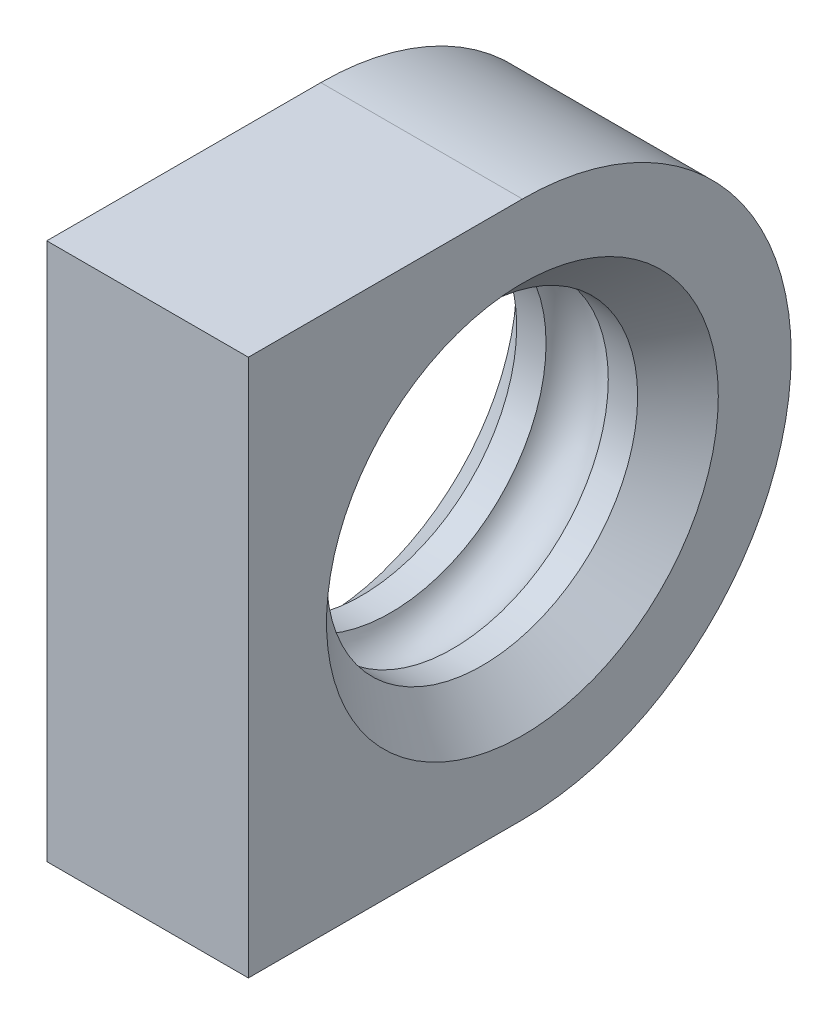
ISO-10303-21;
HEADER;
FILE_DESCRIPTION(('STEP AP214'),'2;1');
FILE_NAME('part.step','',(''),(''),'','','');
FILE_SCHEMA(('AUTOMOTIVE_DESIGN { 1 0 10303 214 1 1 1 1 }'));
ENDSEC;
DATA;
#1=APPLICATION_CONTEXT('core data for automotive mechanical design processes');
#2=APPLICATION_PROTOCOL_DEFINITION('international standard','automotive_design',2000,#1);
#3=PRODUCT_CONTEXT('',#1,'mechanical');
#4=PRODUCT('Part','Part','',(#3));
#5=PRODUCT_RELATED_PRODUCT_CATEGORY('part','',(#4));
#6=PRODUCT_DEFINITION_FORMATION('','',#4);
#7=PRODUCT_DEFINITION_CONTEXT('part definition',#1,'design');
#8=PRODUCT_DEFINITION('design','',#6,#7);
#9=PRODUCT_DEFINITION_SHAPE('','',#8);
#10=(LENGTH_UNIT() NAMED_UNIT(*) SI_UNIT(.MILLI.,.METRE.));
#11=(NAMED_UNIT(*) PLANE_ANGLE_UNIT() SI_UNIT($,.RADIAN.));
#12=(NAMED_UNIT(*) SI_UNIT($,.STERADIAN.) SOLID_ANGLE_UNIT());
#13=UNCERTAINTY_MEASURE_WITH_UNIT(LENGTH_MEASURE(1.E-05),#10,'distance_accuracy_value','');
#14=(GEOMETRIC_REPRESENTATION_CONTEXT(3) GLOBAL_UNCERTAINTY_ASSIGNED_CONTEXT((#13)) GLOBAL_UNIT_ASSIGNED_CONTEXT((#10,
#11,#12)) REPRESENTATION_CONTEXT('',''));
#15=CARTESIAN_POINT('',(0.,0.,0.));
#16=DIRECTION('',(0.,0.,1.));
#17=DIRECTION('',(1.,0.,0.));
#18=AXIS2_PLACEMENT_3D('',#15,#16,#17);
#19=CARTESIAN_POINT('',(0.,0.,0.));
#20=DIRECTION('',(1.,0.,0.));
#21=DIRECTION('',(0.,0.,-1.));
#22=AXIS2_PLACEMENT_3D('',#19,#20,#21);
#23=PLANE('',#22);
#24=DIRECTION('',(0.,0.,-1.));
#25=VECTOR('',#24,1.);
#26=CARTESIAN_POINT('',(0.,-6.35,0.));
#27=LINE('',#26,#25);
#28=CARTESIAN_POINT('',(0.,-6.35,-43.5268184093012));
#29=VERTEX_POINT('',#28);
#30=CARTESIAN_POINT('',(0.,-6.35,-50.));
#31=VERTEX_POINT('',#30);
#32=EDGE_CURVE('E104',#29,#31,#27,.T.);
#33=ORIENTED_EDGE('',*,*,#32,.F.);
#34=DIRECTION('',(0.,1.,0.));
#35=VECTOR('',#34,1.);
#36=CARTESIAN_POINT('',(0.,0.,-43.5268184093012));
#37=LINE('',#36,#35);
#38=CARTESIAN_POINT('',(0.,6.35,-43.5268184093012));
#39=VERTEX_POINT('',#38);
#40=EDGE_CURVE('E92',#29,#39,#37,.T.);
#41=ORIENTED_EDGE('',*,*,#40,.T.);
#42=DIRECTION('',(0.,0.,-1.));
#43=VECTOR('',#42,1.);
#44=CARTESIAN_POINT('',(0.,6.35,0.));
#45=LINE('',#44,#43);
#46=CARTESIAN_POINT('',(0.,6.35,-50.));
#47=VERTEX_POINT('',#46);
#48=EDGE_CURVE('E85',#39,#47,#45,.T.);
#49=ORIENTED_EDGE('',*,*,#48,.T.);
#50=CARTESIAN_POINT('',(0.,0.,-50.));
#51=DIRECTION('',(1.,0.,0.));
#52=DIRECTION('',(0.,0.,-1.));
#53=AXIS2_PLACEMENT_3D('',#50,#51,#52);
#54=CIRCLE('',#53,6.35);
#55=EDGE_CURVE('E89',#31,#47,#54,.T.);
#56=ORIENTED_EDGE('',*,*,#55,.F.);
#57=EDGE_LOOP('',(#33,#41,#49,#56));
#58=FACE_BOUND('',#57,.T.);
#59=CARTESIAN_POINT('',(0.,0.,-50.));
#60=DIRECTION('',(1.,0.,0.));
#61=DIRECTION('',(0.,0.,-1.));
#62=AXIS2_PLACEMENT_3D('',#59,#60,#61);
#63=CIRCLE('',#62,4.62749999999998);
#64=CARTESIAN_POINT('',(0.,0.,-54.6275));
#65=VERTEX_POINT('',#64);
#66=EDGE_CURVE('E110',#65,#65,#63,.T.);
#67=ORIENTED_EDGE('',*,*,#66,.T.);
#68=EDGE_LOOP('',(#67));
#69=FACE_BOUND('',#68,.T.);
#70=ADVANCED_FACE('F43',(#58,#69),#23,.F.);
#71=CARTESIAN_POINT('',(4.7625,0.,-50.));
#72=DIRECTION('',(-1.,0.,0.));
#73=DIRECTION('',(0.,0.,1.));
#74=AXIS2_PLACEMENT_3D('',#71,#72,#73);
#75=CYLINDRICAL_SURFACE('',#74,3.675);
#76=CARTESIAN_POINT('',(1.64637649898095,0.,-50.));
#77=DIRECTION('',(1.,0.,0.));
#78=DIRECTION('',(0.,0.,-1.));
#79=AXIS2_PLACEMENT_3D('',#76,#77,#78);
#80=CIRCLE('',#79,3.675);
#81=CARTESIAN_POINT('',(1.64637649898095,0.,-46.325));
#82=VERTEX_POINT('',#81);
#83=EDGE_CURVE('E48',#82,#82,#80,.F.);
#84=CARTESIAN_POINT('',(0.95249999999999,0.,-50.));
#85=DIRECTION('',(1.,0.,0.));
#86=DIRECTION('',(0.,0.,-1.));
#87=AXIS2_PLACEMENT_3D('',#84,#85,#86);
#88=CIRCLE('',#87,3.675);
#89=CARTESIAN_POINT('',(0.952499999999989,0.,-46.325));
#90=VERTEX_POINT('',#89);
#91=EDGE_CURVE('E11',#90,#90,#88,.F.);
#92=CARTESIAN_POINT('',(1.64637649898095,0.,-46.325));
#93=CARTESIAN_POINT('',(1.63914861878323,0.,-46.325));
#94=CARTESIAN_POINT('',(1.63192073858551,0.,-46.325));
#95=CARTESIAN_POINT('',(1.61746497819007,0.,-46.325));
#96=CARTESIAN_POINT('',(1.61023709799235,0.,-46.325));
#97=CARTESIAN_POINT('',(1.59578133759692,0.,-46.325));
#98=CARTESIAN_POINT('',(1.5885534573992,0.,-46.325));
#99=CARTESIAN_POINT('',(1.57409769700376,0.,-46.325));
#100=CARTESIAN_POINT('',(1.56686981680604,0.,-46.325));
#101=CARTESIAN_POINT('',(1.55241405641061,0.,-46.325));
#102=CARTESIAN_POINT('',(1.54518617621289,0.,-46.325));
#103=CARTESIAN_POINT('',(1.53073041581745,0.,-46.325));
#104=CARTESIAN_POINT('',(1.52350253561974,0.,-46.325));
#105=CARTESIAN_POINT('',(1.5090467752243,0.,-46.325));
#106=CARTESIAN_POINT('',(1.50181889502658,0.,-46.325));
#107=CARTESIAN_POINT('',(1.48736313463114,0.,-46.325));
#108=CARTESIAN_POINT('',(1.48013525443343,0.,-46.325));
#109=CARTESIAN_POINT('',(1.46567949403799,0.,-46.325));
#110=CARTESIAN_POINT('',(1.45845161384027,0.,-46.325));
#111=CARTESIAN_POINT('',(1.44399585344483,0.,-46.325));
#112=CARTESIAN_POINT('',(1.43676797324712,0.,-46.325));
#113=CARTESIAN_POINT('',(1.42231221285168,0.,-46.325));
#114=CARTESIAN_POINT('',(1.41508433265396,0.,-46.325));
#115=CARTESIAN_POINT('',(1.40062857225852,0.,-46.325));
#116=CARTESIAN_POINT('',(1.39340069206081,0.,-46.325));
#117=CARTESIAN_POINT('',(1.37894493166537,0.,-46.325));
#118=CARTESIAN_POINT('',(1.37171705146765,0.,-46.325));
#119=CARTESIAN_POINT('',(1.35726129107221,0.,-46.325));
#120=CARTESIAN_POINT('',(1.3500334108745,0.,-46.325));
#121=CARTESIAN_POINT('',(1.33557765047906,0.,-46.325));
#122=CARTESIAN_POINT('',(1.32834977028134,0.,-46.325));
#123=CARTESIAN_POINT('',(1.3138940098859,0.,-46.325));
#124=CARTESIAN_POINT('',(1.30666612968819,0.,-46.325));
#125=CARTESIAN_POINT('',(1.29221036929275,0.,-46.325));
#126=CARTESIAN_POINT('',(1.28498248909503,0.,-46.325));
#127=CARTESIAN_POINT('',(1.27052672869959,0.,-46.325));
#128=CARTESIAN_POINT('',(1.26329884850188,0.,-46.325));
#129=CARTESIAN_POINT('',(1.24884308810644,0.,-46.325));
#130=CARTESIAN_POINT('',(1.24161520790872,0.,-46.325));
#131=CARTESIAN_POINT('',(1.22715944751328,0.,-46.325));
#132=CARTESIAN_POINT('',(1.21993156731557,0.,-46.325));
#133=CARTESIAN_POINT('',(1.20547580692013,0.,-46.325));
#134=CARTESIAN_POINT('',(1.19824792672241,0.,-46.325));
#135=CARTESIAN_POINT('',(1.18379216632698,0.,-46.325));
#136=CARTESIAN_POINT('',(1.17656428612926,0.,-46.325));
#137=CARTESIAN_POINT('',(1.16210852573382,0.,-46.325));
#138=CARTESIAN_POINT('',(1.1548806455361,0.,-46.325));
#139=CARTESIAN_POINT('',(1.14042488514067,0.,-46.325));
#140=CARTESIAN_POINT('',(1.13319700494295,0.,-46.325));
#141=CARTESIAN_POINT('',(1.11874124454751,0.,-46.325));
#142=CARTESIAN_POINT('',(1.11151336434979,0.,-46.325));
#143=CARTESIAN_POINT('',(1.09705760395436,0.,-46.325));
#144=CARTESIAN_POINT('',(1.08982972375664,0.,-46.325));
#145=CARTESIAN_POINT('',(1.0753739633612,0.,-46.325));
#146=CARTESIAN_POINT('',(1.06814608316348,0.,-46.325));
#147=CARTESIAN_POINT('',(1.05369032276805,0.,-46.325));
#148=CARTESIAN_POINT('',(1.04646244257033,0.,-46.325));
#149=CARTESIAN_POINT('',(1.03200668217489,0.,-46.325));
#150=CARTESIAN_POINT('',(1.02477880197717,0.,-46.325));
#151=CARTESIAN_POINT('',(1.01032304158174,0.,-46.325));
#152=CARTESIAN_POINT('',(1.00309516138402,0.,-46.325));
#153=CARTESIAN_POINT('',(0.988639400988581,0.,-46.325));
#154=CARTESIAN_POINT('',(0.981411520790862,0.,-46.325));
#155=CARTESIAN_POINT('',(0.966955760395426,0.,-46.325));
#156=CARTESIAN_POINT('',(0.959727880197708,0.,-46.325));
#157=CARTESIAN_POINT('',(0.952499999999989,0.,-46.325));
#158=B_SPLINE_CURVE_WITH_KNOTS('',3,(#92,#93,#94,#95,#96,#97,#98,#99,#100,#101,#102,#103,#104,
#105,#106,#107,#108,#109,#110,#111,#112,#113,#114,#115,#116,#117,#118,#119,#120,#121,#122,#123,
#124,#125,#126,#127,#128,#129,#130,#131,#132,#133,#134,#135,#136,#137,#138,#139,#140,#141,#142,
#143,#144,#145,#146,#147,#148,#149,#150,#151,#152,#153,#154,#155,#156,#157),.UNSPECIFIED.,.F.,
.F.,(4,2,2,2,2,2,2,2,2,2,2,2,2,2,2,2,2,2,2,2,2,2,2,2,2,2,2,2,2,2,2,2,4),(0.,0.0216836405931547,
0.0433672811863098,0.0650509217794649,0.0867345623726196,0.108418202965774,0.130101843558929,
0.151785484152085,0.173469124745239,0.195152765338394,0.216836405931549,0.238520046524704,
0.260203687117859,0.281887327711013,0.303570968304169,0.325254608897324,0.346938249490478,
0.368621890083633,0.390305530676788,0.411989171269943,0.433672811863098,0.455356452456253,
0.477040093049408,0.498723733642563,0.520407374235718,0.542091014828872,0.563774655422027,
0.585458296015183,0.607141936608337,0.628825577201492,0.650509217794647,0.672192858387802,
0.693876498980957),.UNSPECIFIED.);
#159=EDGE_CURVE('BSEAM152',#82,#90,#158,.T.);
#160=ORIENTED_EDGE('',*,*,#83,.F.);
#161=ORIENTED_EDGE('',*,*,#91,.T.);
#162=ORIENTED_EDGE('',*,*,#159,.T.);
#163=ORIENTED_EDGE('',*,*,#159,.F.);
#164=EDGE_LOOP('',(#160,#162,#161,#163));
#165=FACE_BOUND('',#164,.T.);
#166=ADVANCED_FACE('F152',(#165),#75,.F.);
#167=CARTESIAN_POINT('',(4.7625,-6.35,0.));
#168=DIRECTION('',(0.,1.,0.));
#169=DIRECTION('',(0.,0.,1.));
#170=AXIS2_PLACEMENT_3D('',#167,#168,#169);
#171=PLANE('',#170);
#172=DIRECTION('',(0.,0.,-1.));
#173=VECTOR('',#172,1.);
#174=CARTESIAN_POINT('',(4.7625,-6.35,0.));
#175=LINE('',#174,#173);
#176=CARTESIAN_POINT('',(4.7625,-6.35,-43.5268184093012));
#177=VERTEX_POINT('',#176);
#178=CARTESIAN_POINT('',(4.7625,-6.35,-50.));
#179=VERTEX_POINT('',#178);
#180=EDGE_CURVE('E93',#177,#179,#175,.T.);
#181=ORIENTED_EDGE('',*,*,#180,.F.);
#182=DIRECTION('',(-1.,0.,0.));
#183=VECTOR('',#182,1.);
#184=CARTESIAN_POINT('',(4.7625,-6.35,-43.5268184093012));
#185=LINE('',#184,#183);
#186=EDGE_CURVE('E61',#177,#29,#185,.T.);
#187=ORIENTED_EDGE('',*,*,#186,.T.);
#188=ORIENTED_EDGE('',*,*,#32,.T.);
#189=DIRECTION('',(-1.,0.,0.));
#190=VECTOR('',#189,1.);
#191=CARTESIAN_POINT('',(4.7625,-6.35,-50.));
#192=LINE('',#191,#190);
#193=EDGE_CURVE('E100',#179,#31,#192,.T.);
#194=ORIENTED_EDGE('',*,*,#193,.F.);
#195=EDGE_LOOP('',(#181,#187,#188,#194));
#196=FACE_BOUND('',#195,.T.);
#197=ADVANCED_FACE('F135',(#196),#171,.F.);
#198=CARTESIAN_POINT('',(4.7625,0.,-50.));
#199=DIRECTION('',(-1.,0.,0.));
#200=DIRECTION('',(0.,0.,1.));
#201=AXIS2_PLACEMENT_3D('',#198,#199,#200);
#202=CYLINDRICAL_SURFACE('',#201,6.35);
#203=ORIENTED_EDGE('',*,*,#55,.T.);
#204=DIRECTION('',(-1.,0.,0.));
#205=VECTOR('',#204,1.);
#206=CARTESIAN_POINT('',(4.7625,6.35,-50.));
#207=LINE('',#206,#205);
#208=CARTESIAN_POINT('',(4.7625,6.35,-50.));
#209=VERTEX_POINT('',#208);
#210=EDGE_CURVE('E96',#209,#47,#207,.T.);
#211=ORIENTED_EDGE('',*,*,#210,.F.);
#212=CARTESIAN_POINT('',(4.7625,0.,-50.));
#213=DIRECTION('',(1.,0.,0.));
#214=DIRECTION('',(0.,0.,-1.));
#215=AXIS2_PLACEMENT_3D('',#212,#213,#214);
#216=CIRCLE('',#215,6.35);
#217=EDGE_CURVE('E130',#179,#209,#216,.T.);
#218=ORIENTED_EDGE('',*,*,#217,.F.);
#219=ORIENTED_EDGE('',*,*,#193,.T.);
#220=EDGE_LOOP('',(#203,#211,#218,#219));
#221=FACE_BOUND('',#220,.T.);
#222=ADVANCED_FACE('F102',(#221),#202,.T.);
#223=CARTESIAN_POINT('',(4.7625,6.35,0.));
#224=DIRECTION('',(0.,1.,0.));
#225=DIRECTION('',(0.,0.,1.));
#226=AXIS2_PLACEMENT_3D('',#223,#224,#225);
#227=PLANE('',#226);
#228=DIRECTION('',(-1.,0.,0.));
#229=VECTOR('',#228,1.);
#230=CARTESIAN_POINT('',(4.7625,6.35,-43.5268184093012));
#231=LINE('',#230,#229);
#232=CARTESIAN_POINT('',(4.7625,6.35,-43.5268184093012));
#233=VERTEX_POINT('',#232);
#234=EDGE_CURVE('E125',#233,#39,#231,.T.);
#235=ORIENTED_EDGE('',*,*,#234,.F.);
#236=DIRECTION('',(0.,0.,-1.));
#237=VECTOR('',#236,1.);
#238=CARTESIAN_POINT('',(4.7625,6.35,0.));
#239=LINE('',#238,#237);
#240=EDGE_CURVE('E70',#233,#209,#239,.T.);
#241=ORIENTED_EDGE('',*,*,#240,.T.);
#242=ORIENTED_EDGE('',*,*,#210,.T.);
#243=ORIENTED_EDGE('',*,*,#48,.F.);
#244=EDGE_LOOP('',(#235,#241,#242,#243));
#245=FACE_BOUND('',#244,.T.);
#246=ADVANCED_FACE('F97',(#245),#227,.T.);
#247=CARTESIAN_POINT('',(3.11612350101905,0.,-50.));
#248=DIRECTION('',(-1.,0.,0.));
#249=DIRECTION('',(0.,0.,1.));
#250=AXIS2_PLACEMENT_3D('',#247,#248,#249);
#251=CIRCLE('',#250,3.675);
#252=CARTESIAN_POINT('',(3.11612350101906,0.,-46.325));
#253=VERTEX_POINT('',#252);
#254=EDGE_CURVE('E117',#253,#253,#251,.F.);
#255=CARTESIAN_POINT('',(3.80999999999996,0.,-50.));
#256=DIRECTION('',(1.,0.,0.));
#257=DIRECTION('',(0.,0.,-1.));
#258=AXIS2_PLACEMENT_3D('',#255,#256,#257);
#259=CIRCLE('',#258,3.675);
#260=CARTESIAN_POINT('',(3.80999999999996,0.,-46.325));
#261=VERTEX_POINT('',#260);
#262=EDGE_CURVE('E53',#261,#261,#259,.T.);
#263=CARTESIAN_POINT('',(3.11612350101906,0.,-46.325));
#264=CARTESIAN_POINT('',(3.12335138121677,0.,-46.325));
#265=CARTESIAN_POINT('',(3.13057926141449,0.,-46.325));
#266=CARTESIAN_POINT('',(3.14503502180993,0.,-46.325));
#267=CARTESIAN_POINT('',(3.15226290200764,0.,-46.325));
#268=CARTESIAN_POINT('',(3.16671866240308,0.,-46.325));
#269=CARTESIAN_POINT('',(3.1739465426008,0.,-46.325));
#270=CARTESIAN_POINT('',(3.18840230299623,0.,-46.325));
#271=CARTESIAN_POINT('',(3.19563018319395,0.,-46.325));
#272=CARTESIAN_POINT('',(3.21008594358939,0.,-46.325));
#273=CARTESIAN_POINT('',(3.2173138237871,0.,-46.325));
#274=CARTESIAN_POINT('',(3.23176958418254,0.,-46.325));
#275=CARTESIAN_POINT('',(3.23899746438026,0.,-46.325));
#276=CARTESIAN_POINT('',(3.25345322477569,0.,-46.325));
#277=CARTESIAN_POINT('',(3.26068110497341,0.,-46.325));
#278=CARTESIAN_POINT('',(3.27513686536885,0.,-46.325));
#279=CARTESIAN_POINT('',(3.28236474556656,0.,-46.325));
#280=CARTESIAN_POINT('',(3.296820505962,0.,-46.325));
#281=CARTESIAN_POINT('',(3.30404838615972,0.,-46.325));
#282=CARTESIAN_POINT('',(3.31850414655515,0.,-46.325));
#283=CARTESIAN_POINT('',(3.32573202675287,0.,-46.325));
#284=CARTESIAN_POINT('',(3.3401877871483,0.,-46.325));
#285=CARTESIAN_POINT('',(3.34741566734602,0.,-46.325));
#286=CARTESIAN_POINT('',(3.36187142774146,0.,-46.325));
#287=CARTESIAN_POINT('',(3.36909930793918,0.,-46.325));
#288=CARTESIAN_POINT('',(3.38355506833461,0.,-46.325));
#289=CARTESIAN_POINT('',(3.39078294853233,0.,-46.325));
#290=CARTESIAN_POINT('',(3.40523870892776,0.,-46.325));
#291=CARTESIAN_POINT('',(3.41246658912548,0.,-46.325));
#292=CARTESIAN_POINT('',(3.42692234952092,0.,-46.325));
#293=CARTESIAN_POINT('',(3.43415022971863,0.,-46.325));
#294=CARTESIAN_POINT('',(3.44860599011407,0.,-46.325));
#295=CARTESIAN_POINT('',(3.45583387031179,0.,-46.325));
#296=CARTESIAN_POINT('',(3.47028963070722,0.,-46.325));
#297=CARTESIAN_POINT('',(3.47751751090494,0.,-46.325));
#298=CARTESIAN_POINT('',(3.49197327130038,0.,-46.325));
#299=CARTESIAN_POINT('',(3.49920115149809,0.,-46.325));
#300=CARTESIAN_POINT('',(3.51365691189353,0.,-46.325));
#301=CARTESIAN_POINT('',(3.52088479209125,0.,-46.325));
#302=CARTESIAN_POINT('',(3.53534055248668,0.,-46.325));
#303=CARTESIAN_POINT('',(3.5425684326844,0.,-46.325));
#304=CARTESIAN_POINT('',(3.55702419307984,0.,-46.325));
#305=CARTESIAN_POINT('',(3.56425207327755,0.,-46.325));
#306=CARTESIAN_POINT('',(3.57870783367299,0.,-46.325));
#307=CARTESIAN_POINT('',(3.58593571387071,0.,-46.325));
#308=CARTESIAN_POINT('',(3.60039147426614,0.,-46.325));
#309=CARTESIAN_POINT('',(3.60761935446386,0.,-46.325));
#310=CARTESIAN_POINT('',(3.6220751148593,0.,-46.325));
#311=CARTESIAN_POINT('',(3.62930299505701,0.,-46.325));
#312=CARTESIAN_POINT('',(3.64375875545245,0.,-46.325));
#313=CARTESIAN_POINT('',(3.65098663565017,0.,-46.325));
#314=CARTESIAN_POINT('',(3.6654423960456,0.,-46.325));
#315=CARTESIAN_POINT('',(3.67267027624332,0.,-46.325));
#316=CARTESIAN_POINT('',(3.68712603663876,0.,-46.325));
#317=CARTESIAN_POINT('',(3.69435391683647,0.,-46.325));
#318=CARTESIAN_POINT('',(3.70880967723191,0.,-46.325));
#319=CARTESIAN_POINT('',(3.71603755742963,0.,-46.325));
#320=CARTESIAN_POINT('',(3.73049331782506,0.,-46.325));
#321=CARTESIAN_POINT('',(3.73772119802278,0.,-46.325));
#322=CARTESIAN_POINT('',(3.75217695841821,0.,-46.325));
#323=CARTESIAN_POINT('',(3.75940483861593,0.,-46.325));
#324=CARTESIAN_POINT('',(3.77386059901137,0.,-46.325));
#325=CARTESIAN_POINT('',(3.78108847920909,0.,-46.325));
#326=CARTESIAN_POINT('',(3.79554423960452,0.,-46.325));
#327=CARTESIAN_POINT('',(3.80277211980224,0.,-46.325));
#328=CARTESIAN_POINT('',(3.80999999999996,0.,-46.325));
#329=B_SPLINE_CURVE_WITH_KNOTS('',3,(#263,#264,#265,#266,#267,#268,#269,#270,#271,#272,#273,
#274,#275,#276,#277,#278,#279,#280,#281,#282,#283,#284,#285,#286,#287,#288,#289,#290,#291,#292,
#293,#294,#295,#296,#297,#298,#299,#300,#301,#302,#303,#304,#305,#306,#307,#308,#309,#310,#311,
#312,#313,#314,#315,#316,#317,#318,#319,#320,#321,#322,#323,#324,#325,#326,#327,#328),
.UNSPECIFIED.,.F.,.F.,(4,2,2,2,2,2,2,2,2,2,2,2,2,2,2,2,2,2,2,2,2,2,2,2,2,2,2,2,2,2,2,2,4),(0.,
0.0216836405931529,0.0433672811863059,0.0650509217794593,0.0867345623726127,0.108418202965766,
0.130101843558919,0.151785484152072,0.173469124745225,0.195152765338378,0.216836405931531,
0.238520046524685,0.260203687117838,0.281887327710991,0.303570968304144,0.325254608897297,
0.346938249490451,0.368621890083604,0.390305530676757,0.41198917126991,0.433672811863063,
0.455356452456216,0.477040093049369,0.498723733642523,0.520407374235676,0.542091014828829,
0.563774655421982,0.585458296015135,0.607141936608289,0.628825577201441,0.650509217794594,
0.672192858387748,0.693876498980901),.UNSPECIFIED.);
#330=EDGE_CURVE('BSEAM160',#253,#261,#329,.T.);
#331=ORIENTED_EDGE('',*,*,#254,.F.);
#332=ORIENTED_EDGE('',*,*,#262,.T.);
#333=ORIENTED_EDGE('',*,*,#330,.T.);
#334=ORIENTED_EDGE('',*,*,#330,.F.);
#335=EDGE_LOOP('',(#331,#333,#332,#334));
#336=FACE_BOUND('',#335,.T.);
#337=ADVANCED_FACE('F160',(#336),#75,.F.);
#338=CARTESIAN_POINT('',(4.7625,0.,0.));
#339=DIRECTION('',(1.,0.,0.));
#340=DIRECTION('',(0.,0.,-1.));
#341=AXIS2_PLACEMENT_3D('',#338,#339,#340);
#342=PLANE('',#341);
#343=DIRECTION('',(0.,-1.,0.));
#344=VECTOR('',#343,1.);
#345=CARTESIAN_POINT('',(4.7625,-24.167966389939,-43.5268184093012));
#346=LINE('',#345,#344);
#347=EDGE_CURVE('E139',#233,#177,#346,.T.);
#348=ORIENTED_EDGE('',*,*,#347,.T.);
#349=ORIENTED_EDGE('',*,*,#180,.T.);
#350=ORIENTED_EDGE('',*,*,#217,.T.);
#351=ORIENTED_EDGE('',*,*,#240,.F.);
#352=EDGE_LOOP('',(#348,#349,#350,#351));
#353=FACE_BOUND('',#352,.T.);
#354=CARTESIAN_POINT('',(4.7625,0.,-50.));
#355=DIRECTION('',(1.,0.,0.));
#356=DIRECTION('',(0.,0.,-1.));
#357=AXIS2_PLACEMENT_3D('',#354,#355,#356);
#358=CIRCLE('',#357,4.62750000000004);
#359=CARTESIAN_POINT('',(4.7625,0.,-54.6275));
#360=VERTEX_POINT('',#359);
#361=EDGE_CURVE('E113',#360,#360,#358,.F.);
#362=ORIENTED_EDGE('',*,*,#361,.T.);
#363=EDGE_LOOP('',(#362));
#364=FACE_BOUND('',#363,.T.);
#365=ADVANCED_FACE('F132',(#353,#364),#342,.T.);
#366=CARTESIAN_POINT('',(0.,0.,-50.));
#367=DIRECTION('',(-1.,0.,0.));
#368=DIRECTION('',(0.,0.,1.));
#369=AXIS2_PLACEMENT_3D('',#366,#367,#368);
#370=CONICAL_SURFACE('',#369,4.62749999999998,0.785398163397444);
#371=ORIENTED_EDGE('',*,*,#91,.F.);
#372=EDGE_LOOP('',(#371));
#373=FACE_BOUND('',#372,.T.);
#374=ORIENTED_EDGE('',*,*,#66,.F.);
#375=EDGE_LOOP('',(#374));
#376=FACE_BOUND('',#375,.T.);
#377=ADVANCED_FACE('F170',(#373,#376),#370,.F.);
#378=CARTESIAN_POINT('',(3.80999999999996,0.,-50.));
#379=DIRECTION('',(1.,0.,0.));
#380=DIRECTION('',(0.,0.,-1.));
#381=AXIS2_PLACEMENT_3D('',#378,#379,#380);
#382=CONICAL_SURFACE('',#381,3.675,0.785398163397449);
#383=ORIENTED_EDGE('',*,*,#361,.F.);
#384=EDGE_LOOP('',(#383));
#385=FACE_BOUND('',#384,.T.);
#386=ORIENTED_EDGE('',*,*,#262,.F.);
#387=EDGE_LOOP('',(#386));
#388=FACE_BOUND('',#387,.T.);
#389=ADVANCED_FACE('F46',(#385,#388),#382,.F.);
#390=CARTESIAN_POINT('',(2.38125,0.,-50.));
#391=DIRECTION('',(-1.,0.,0.));
#392=DIRECTION('',(0.,0.,1.));
#393=AXIS2_PLACEMENT_3D('',#390,#391,#392);
#394=TOROIDAL_SURFACE('',#393,3.375,0.79375);
#395=ORIENTED_EDGE('',*,*,#83,.T.);
#396=EDGE_LOOP('',(#395));
#397=FACE_BOUND('',#396,.T.);
#398=ORIENTED_EDGE('',*,*,#254,.T.);
#399=EDGE_LOOP('',(#398));
#400=FACE_BOUND('',#399,.T.);
#401=ADVANCED_FACE('F143',(#397,#400),#394,.F.);
#402=CARTESIAN_POINT('',(4.7625,-24.167966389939,-43.5268184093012));
#403=DIRECTION('',(0.,0.,-1.));
#404=DIRECTION('',(-1.,0.,0.));
#405=AXIS2_PLACEMENT_3D('',#402,#403,#404);
#406=PLANE('',#405);
#407=ORIENTED_EDGE('',*,*,#347,.F.);
#408=ORIENTED_EDGE('',*,*,#234,.T.);
#409=ORIENTED_EDGE('',*,*,#40,.F.);
#410=ORIENTED_EDGE('',*,*,#186,.F.);
#411=EDGE_LOOP('',(#407,#408,#409,#410));
#412=FACE_BOUND('',#411,.T.);
#413=ADVANCED_FACE('F140',(#412),#406,.F.);
#414=CLOSED_SHELL('',(#70,#166,#197,#222,#246,#337,#365,#377,#389,#401,#413));
#415=MANIFOLD_SOLID_BREP('B2',#414);
#416=ADVANCED_BREP_SHAPE_REPRESENTATION('',(#18,#415),#14);
#417=SHAPE_DEFINITION_REPRESENTATION(#9,#416);
ENDSEC;
END-ISO-10303-21;
